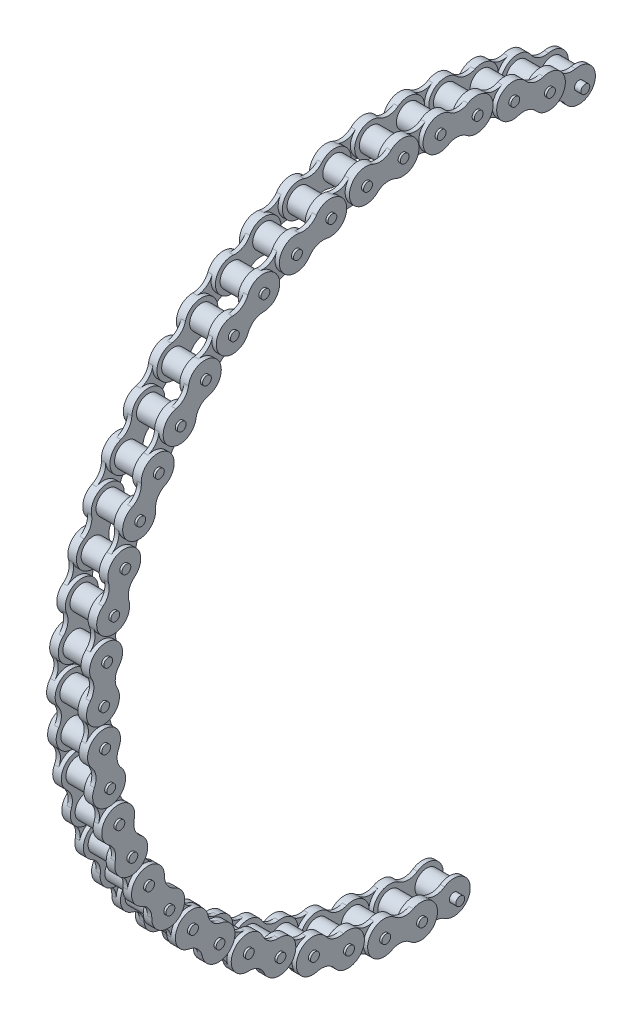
from build123d import *

# Parameters (mm, degrees)
BOSS_EXTRU_5_DEPTH      = 2.202
BOSS_EXTRU_5_2_DEPTH    = 2.202
BOSS_EXTRU_5_3_DEPTH    = 2.202
BOSS_EXTRU_5_4_DEPTH    = 2.202
BOSS_EXTRU_5_5_DEPTH    = 2.202
BOSS_EXTRU_5_6_DEPTH    = 2.202
BOSS_EXTRU_5_7_DEPTH    = 2.202
BOSS_EXTRU_5_8_DEPTH    = 2.202
BOSS_EXTRU_5_9_DEPTH    = 2.202
BOSS_EXTRU_5_10_DEPTH   = 2.202
BOSS_EXTRU_5_11_DEPTH   = 2.202
BOSS_EXTRU_5_12_DEPTH   = 2.202
BOSS_EXTRU_5_13_DEPTH   = 2.202
BOSS_EXTRU_5_14_DEPTH   = 2.202
BOSS_EXTRU_5_15_DEPTH   = 2.202
BOSS_EXTRU_5_16_DEPTH   = 2.202
BOSS_EXTRU_5_17_DEPTH   = 2.202
ESQUISSE4_R             = 6.05
BOSS_EXTRU_6_DEPTH      = 11.7
BOSS_EXTRU_7_DEPTH      = 2.202
BOSS_EXTRU_8_DEPTH      = 3.303
BOSS_EXTRU_8_DEPTH_BACK = 19.407
ESQUISSE6_R             = 2.269
BOSS_EXTRU_9_DEPTH      = 2.202
BOSS_EXTRU_10_START     = 2.202
BOSS_EXTRU_10_DEPTH     = 2.202
BOSS_EXTRU_11_START     = 2.202
BOSS_EXTRU_11_DEPTH     = 2.202


with BuildPart() as part:
    # Esquisse2 → Boss.-Extru.5 (new body)
    with BuildSketch(Plane(origin=(5.55, 0, 0), x_dir=(0, 0, -1), z_dir=(1, 0, 0))):
        with BuildLine():
            ThreePointArc((66.741727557, 151.674368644), (81.631052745, 153.185208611), (72.012148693, 164.650431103))
            ThreePointArc((72.012148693, 164.650431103), (67.051658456, 165.084816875), (63.193169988, 168.232390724))
            ThreePointArc((63.193169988, 168.232390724), (48.3038448, 166.721550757), (57.922748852, 155.256328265))
            ThreePointArc((57.922748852, 155.256328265), (62.883239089, 154.821942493), (66.741727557, 151.674368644))
        make_face()
    extrude(amount=BOSS_EXTRU_5_DEPTH)



with BuildPart() as body_2:
    # Esquisse2 → Boss.-Extru.5 2 (new body)
    with BuildSketch(Plane(origin=(5.55, 0, 0), x_dir=(0, 0, -1), z_dir=(1, 0, 0))):
        with BuildLine():
            ThreePointArc((31.958066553, 162.598444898), (46.156625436, 167.328726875), (34.2633089, 176.412980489))
            ThreePointArc((34.2633089, 176.412980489), (29.327888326, 175.752088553), (24.874474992, 177.979702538))
            ThreePointArc((24.874474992, 177.979702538), (10.675916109, 173.249420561), (22.569232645, 164.165166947))
            ThreePointArc((22.569232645, 164.165166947), (27.504653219, 164.826058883), (31.958066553, 162.598444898))
        make_face()
    extrude(amount=BOSS_EXTRU_5_2_DEPTH)


with BuildPart() as body_3:
    # Esquisse2 → Boss.-Extru.5 3 (new body)
    with BuildSketch(Plane(origin=(5.55, 0, 0), x_dir=(0, 0, -1), z_dir=(1, 0, 0))):
        with BuildLine():
            ThreePointArc((-4.372592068, 165.651600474), (8.44788932, 173.372345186), (-5.144118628, 179.635887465))
            ThreePointArc((-5.144118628, 179.635887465), (-9.815560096, 177.911709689), (-14.648321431, 179.111531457))
            ThreePointArc((-14.648321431, 179.111531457), (-27.468802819, 171.390786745), (-13.876794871, 165.127244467))
            ThreePointArc((-13.876794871, 165.127244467), (-9.205353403, 166.851422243), (-4.372592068, 165.651600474))
        make_face()
    extrude(amount=BOSS_EXTRU_5_3_DEPTH)


with BuildPart() as body_4:
    # Esquisse2 → Boss.-Extru.5 4 (new body)
    with BuildSketch(Plane(origin=(5.55, 0, 0), x_dir=(0, 0, -1), z_dir=(1, 0, 0))):
        with BuildLine():
            ThreePointArc((-40.491586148, 160.686040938), (-29.669784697, 171.023509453), (-44.302534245, 174.163140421))
            ThreePointArc((-44.302534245, 174.163140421), (-48.483865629, 171.459139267), (-53.462034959, 171.573088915))
            ThreePointArc((-53.462034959, 171.573088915), (-64.28383641, 161.2356204), (-49.651086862, 158.095989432))
            ThreePointArc((-49.651086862, 158.095989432), (-45.469755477, 160.799990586), (-40.491586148, 160.686040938))
        make_face()
    extrude(amount=BOSS_EXTRU_5_4_DEPTH)


with BuildPart() as body_5:
    # Esquisse2 → Boss.-Extru.5 5 (new body)
    with BuildSketch(Plane(origin=(5.55, 0, 0), x_dir=(0, 0, -1), z_dir=(1, 0, 0))):
        with BuildLine():
            ThreePointArc((-74.650499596, 147.942134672), (-66.351230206, 160.395920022), (-81.316392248, 160.259659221))
            ThreePointArc((-81.316392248, 160.259659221), (-84.805207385, 156.706727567), (-89.687805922, 155.729289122))
            ThreePointArc((-89.687805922, 155.729289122), (-97.987075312, 143.275503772), (-83.02191327, 143.411764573))
            ThreePointArc((-83.02191327, 143.411764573), (-79.533098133, 146.964696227), (-74.650499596, 147.942134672))
        make_face()
    extrude(amount=BOSS_EXTRU_5_5_DEPTH)


with BuildPart() as body_6:
    # Esquisse2 → Boss.-Extru.5 6 (new body)
    with BuildSketch(Plane(origin=(5.55, 0, 0), x_dir=(0, 0, -1), z_dir=(1, 0, 0))):
        with BuildLine():
            ThreePointArc((-105.195798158, 128.036777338), (-99.820804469, 142.004027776), (-114.393958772, 138.598471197))
            ThreePointArc((-114.393958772, 138.598471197), (-117.021374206, 134.368596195), (-121.572049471, 132.347084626))
            ThreePointArc((-121.572049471, 132.347084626), (-126.94704316, 118.379834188), (-112.373888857, 121.785390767))
            ThreePointArc((-112.373888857, 121.785390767), (-109.746473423, 126.015265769), (-105.195798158, 128.036777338))
        make_face()
    extrude(amount=BOSS_EXTRU_5_6_DEPTH)


with BuildPart() as body_7:
    # Esquisse2 → Boss.-Extru.5 7 (new body)
    with BuildSketch(Plane(origin=(5.55, 0, 0), x_dir=(0, 0, -1), z_dir=(1, 0, 0))):
        with BuildLine():
            ThreePointArc((-130.648872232, 101.933529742), (-128.458342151, 116.738131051), (-141.934044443, 110.228131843))
            ThreePointArc((-141.934044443, 110.228131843), (-143.572874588, 105.526069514), (-147.571341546, 102.558340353))
            ThreePointArc((-147.571341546, 102.558340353), (-149.761871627, 87.753739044), (-136.286169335, 94.263738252))
            ThreePointArc((-136.286169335, 94.263738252), (-134.64733919, 98.965800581), (-130.648872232, 101.933529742))
        make_face()
    extrude(amount=BOSS_EXTRU_5_7_DEPTH)


with BuildPart() as body_8:
    # Esquisse2 → Boss.-Extru.5 8 (new body)
    with BuildSketch(Plane(origin=(5.55, 0, 0), x_dir=(0, 0, -1), z_dir=(1, 0, 0))):
        with BuildLine():
            ThreePointArc((-149.777612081, 70.895974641), (-150.877582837, 85.821278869), (-162.603513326, 76.521967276))
            ThreePointArc((-162.603513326, 76.521967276), (-163.174427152, 71.575330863), (-166.427131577, 67.805043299))
            ThreePointArc((-166.427131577, 67.805043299), (-165.327160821, 52.879739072), (-153.601230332, 62.179050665))
            ThreePointArc((-153.601230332, 62.179050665), (-153.030316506, 67.125687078), (-149.777612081, 70.895974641))
        make_face()
    extrude(amount=BOSS_EXTRU_5_8_DEPTH)


with BuildPart() as body_9:
    # Esquisse2 → Boss.-Extru.5 9 (new body)
    with BuildSketch(Plane(origin=(5.55, 0, 0), x_dir=(0, 0, -1), z_dir=(1, 0, 0))):
        with BuildLine():
            ThreePointArc((-161.656050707, 36.426550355), (-165.993275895, 50.75006667), (-175.401816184, 39.111595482))
            ThreePointArc((-175.401816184, 39.111595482), (-174.877177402, 34.159837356), (-177.226665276, 29.769500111))
            ThreePointArc((-177.226665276, 29.769500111), (-172.889440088, 15.445983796), (-163.4808998, 27.084454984))
            ThreePointArc((-163.4808998, 27.084454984), (-164.005538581, 32.03621311), (-161.656050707, 36.426550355))
        make_face()
    extrude(amount=BOSS_EXTRU_5_9_DEPTH)


with BuildPart() as body_10:
    # Esquisse2 → Boss.-Extru.5 10 (new body)
    with BuildSketch(Plane(origin=(5.55, 0, 0), x_dir=(0, 0, -1), z_dir=(1, 0, 0))):
        with BuildLine():
            ThreePointArc((-165.709187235, 0.193822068), (-173.073714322, 13.222190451), (-179.709424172, -0.192055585))
            ThreePointArc((-179.709424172, -0.192055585), (-178.114629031, -4.909235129), (-179.447168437, -9.707098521))
            ThreePointArc((-179.447168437, -9.707098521), (-172.08264135, -22.735466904), (-165.446931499, -9.321220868))
            ThreePointArc((-165.446931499, -9.321220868), (-167.041726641, -4.604041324), (-165.709187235, 0.193822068))
        make_face()
    extrude(amount=BOSS_EXTRU_5_10_DEPTH)


with BuildPart() as body_11:
    # Esquisse2 → Boss.-Extru.5 11 (new body)
    with BuildSketch(Plane(origin=(5.55, 0, 0), x_dir=(0, 0, -1), z_dir=(1, 0, 0))):
        with BuildLine():
            ThreePointArc((-161.740821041, -36.048288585), (-171.77615456, -24.945733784), (-175.317818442, -39.486409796))
            ThreePointArc((-175.317818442, -39.486409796), (-172.730066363, -43.740665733), (-172.98115292, -48.713804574))
            ThreePointArc((-172.98115292, -48.713804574), (-162.945819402, -59.816359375), (-159.40415552, -45.275683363))
            ThreePointArc((-159.40415552, -45.275683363), (-161.991907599, -41.021427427), (-161.740821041, -36.048288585))
        make_face()
    extrude(amount=BOSS_EXTRU_5_11_DEPTH)


with BuildPart() as body_12:
    # Esquisse2 → Boss.-Extru.5 12 (new body)
    with BuildSketch(Plane(origin=(5.55, 0, 0), x_dir=(0, 0, -1), z_dir=(1, 0, 0))):
        with BuildLine():
            ThreePointArc((-149.943049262, -70.545405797), (-162.163407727, -61.90610716), (-162.439583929, -76.869341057))
            ThreePointArc((-162.439583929, -76.869341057), (-158.984140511, -80.454737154), (-158.141619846, -85.36241617))
            ThreePointArc((-158.141619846, -85.36241617), (-145.921261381, -94.001714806), (-145.645085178, -79.038480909))
            ThreePointArc((-145.645085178, -79.038480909), (-149.100528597, -75.453084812), (-149.943049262, -70.545405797))
        make_face()
    extrude(amount=BOSS_EXTRU_5_12_DEPTH)


with BuildPart() as body_13:
    # Esquisse2 → Boss.-Extru.5 13 (new body)
    with BuildSketch(Plane(origin=(5.55, 0, 0), x_dir=(0, 0, -1), z_dir=(1, 0, 0))):
        with BuildLine():
            ThreePointArc((-130.886967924, -101.627623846), (-144.700799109, -95.869784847), (-141.69811874, -110.531249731))
            ThreePointArc((-141.69811874, -110.531249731), (-137.542252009, -113.274227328), (-135.646908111, -117.878879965))
            ThreePointArc((-135.646908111, -117.878879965), (-121.833076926, -123.636718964), (-124.835757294, -108.97525408))
            ThreePointArc((-124.835757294, -108.97525408), (-128.991624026, -106.232276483), (-130.886967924, -101.627623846))
        make_face()
    extrude(amount=BOSS_EXTRU_5_13_DEPTH)


with BuildPart() as body_14:
    # Esquisse2 → Boss.-Extru.5 14 (new body)
    with BuildSketch(Plane(origin=(5.55, 0, 0), x_dir=(0, 0, -1), z_dir=(1, 0, 0))):
        with BuildLine():
            ThreePointArc((-105.495026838, -127.790342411), (-120.233643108, -125.19268339), (-114.097457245, -138.84266013))
            ThreePointArc((-114.097457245, -138.84266013), (-109.442340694, -140.610439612), (-106.585921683, -144.689167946))
            ThreePointArc((-106.585921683, -144.689167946), (-91.847305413, -147.286826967), (-97.983491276, -133.636850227))
            ThreePointArc((-97.983491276, -133.636850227), (-102.638607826, -131.869070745), (-105.495026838, -127.790342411))
        make_face()
    extrude(amount=BOSS_EXTRU_5_14_DEPTH)


with BuildPart() as body_15:
    # Esquisse2 → Boss.-Extru.5 15 (new body)
    with BuildSketch(Plane(origin=(5.55, 0, 0), x_dir=(0, 0, -1), z_dir=(1, 0, 0))):
        with BuildLine():
            ThreePointArc((-74.996376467, -147.767099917), (-89.946324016, -148.455366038), (-80.973667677, -160.433098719))
            ThreePointArc((-80.973667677, -160.433098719), (-76.044642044, -161.14010699), (-72.365418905, -164.495471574))
            ThreePointArc((-72.365418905, -164.495471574), (-57.415471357, -163.807205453), (-66.388127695, -151.829472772))
            ThreePointArc((-66.388127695, -151.829472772), (-71.317153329, -151.1224645), (-74.996376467, -147.767099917))
        make_face()
    extrude(amount=BOSS_EXTRU_5_15_DEPTH)


with BuildPart() as body_16:
    # Esquisse2 → Boss.-Extru.5 16 (new body)
    with BuildSketch(Plane(origin=(5.55, 0, 0), x_dir=(0, 0, -1), z_dir=(1, 0, 0))):
        with BuildLine():
            ThreePointArc((-40.867368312, -160.590879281), (-55.304963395, -164.531753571), (-43.930176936, -174.25743478))
            ThreePointArc((-43.930176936, -174.25743478), (-38.965842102, -173.869447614), (-34.641915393, -176.339024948))
            ThreePointArc((-34.641915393, -176.339024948), (-20.20432031, -172.398150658), (-31.579106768, -162.672469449))
            ThreePointArc((-31.579106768, -162.672469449), (-36.543441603, -163.060456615), (-40.867368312, -160.590879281))
        make_face()
    extrude(amount=BOSS_EXTRU_5_16_DEPTH)


with BuildPart() as body_17:
    # Esquisse2 → Boss.-Extru.5 17 (new body)
    with BuildSketch(Plane(origin=(5.55, 0, 0), x_dir=(0, 0, -1), z_dir=(1, 0, 0))):
        with BuildLine():
            ThreePointArc((-4.760088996, -165.640918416), (-17.986449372, -172.643634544), (-4.760153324, -179.646472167))
            ThreePointArc((-4.760153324, -179.646472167), (-0.000818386, -178.182270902), (4.758503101, -179.646515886))
            ThreePointArc((4.758503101, -179.646515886), (17.984863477, -172.643799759), (4.758567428, -165.640962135))
            ThreePointArc((4.758567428, -165.640962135), (-0.000767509, -167.1051634), (-4.760088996, -165.640918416))
        make_face()
    extrude(amount=BOSS_EXTRU_5_17_DEPTH)


with BuildPart() as part_1:
    add(part.part)

    add(body_2.part)  # Boss.-Extru.6 merges body 2

    add(body_3.part)  # Boss.-Extru.6 merges body 3

    add(body_4.part)  # Boss.-Extru.6 merges body 4

    add(body_5.part)  # Boss.-Extru.6 merges body 5

    add(body_6.part)  # Boss.-Extru.6 merges body 6

    add(body_7.part)  # Boss.-Extru.6 merges body 7

    add(body_8.part)  # Boss.-Extru.6 merges body 8

    add(body_9.part)  # Boss.-Extru.6 merges body 9

    add(body_10.part)  # Boss.-Extru.6 merges body 10

    add(body_11.part)  # Boss.-Extru.6 merges body 11

    add(body_12.part)  # Boss.-Extru.6 merges body 12

    add(body_13.part)  # Boss.-Extru.6 merges body 13

    add(body_14.part)  # Boss.-Extru.6 merges body 14

    add(body_15.part)  # Boss.-Extru.6 merges body 15

    add(body_16.part)  # Boss.-Extru.6 merges body 16

    add(body_17.part)  # Boss.-Extru.6 merges body 17
    # Esquisse4 → Boss.-Extru.6 (add)
    with BuildSketch(Plane(origin=(7.752, 0, 0), x_dir=(0, 0, -1), z_dir=(1, 0, 0))):
        with Locations((73.786427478, 156.371420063)):
            Circle(ESQUISSE4_R)
        with Locations((56.148470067, 163.535339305)):
            Circle(ESQUISSE4_R)
        with Locations((37.805104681, 168.722351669)):
            Circle(ESQUISSE4_R)
        with Locations((19.027436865, 171.855795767)):
            Circle(ESQUISSE4_R)
        with Locations((-0.006253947, 172.905921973)):
            Circle(ESQUISSE4_R)
        with Locations((-19.014659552, 171.857209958)):
            Circle(ESQUISSE4_R)
        with Locations((-37.817309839, 168.719616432)):
            Circle(ESQUISSE4_R)
        with Locations((-56.136311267, 163.53951342)):
            Circle(ESQUISSE4_R)
        with Locations((-73.797739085, 156.366081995)):
            Circle(ESQUISSE4_R)
        with Locations((-90.540566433, 147.305341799)):
            Circle(ESQUISSE4_R)
        with Locations((-106.205833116, 136.443317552)):
            Circle(ESQUISSE4_R)
        with Locations((-120.562014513, 123.940544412)):
            Circle(ESQUISSE4_R)
        with Locations((-133.472809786, 109.915726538)):
            Circle(ESQUISSE4_R)
        with Locations((-144.747403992, 94.576143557)):
            Circle(ESQUISSE4_R)
        with Locations((-154.278753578, 78.067432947)):
            Circle(ESQUISSE4_R)
        with Locations((-161.92599008, 60.633584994)):
            Circle(ESQUISSE4_R)
        with Locations((-167.616508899, 42.440120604)):
            Circle(ESQUISSE4_R)
        with Locations((-171.266207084, 23.755929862)):
            Circle(ESQUISSE4_R)
        with Locations((-172.840433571, 4.758404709)):
            Circle(ESQUISSE4_R)
        with Locations((-172.3159221, -14.271681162)):
            Circle(ESQUISSE4_R)
        with Locations((-169.697652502, -33.153651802)):
            Circle(ESQUISSE4_R)
        with Locations((-165.02432146, -51.608441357)):
            Circle(ESQUISSE4_R)
        with Locations((-158.340298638, -69.460835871)):
            Circle(ESQUISSE4_R)
        with Locations((-149.74437047, -86.446986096)):
            Circle(ESQUISSE4_R)
        with Locations((-139.318148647, -102.405621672)):
            Circle(ESQUISSE4_R)
        with Locations((-127.215727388, -117.100882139)):
            Circle(ESQUISSE4_R)
        with Locations((-113.552009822, -130.393247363)):
            Circle(ESQUISSE4_R)
        with Locations((-98.528938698, -142.086262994)):
            Circle(ESQUISSE4_R)
        with Locations((-82.289146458, -152.068912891)):
            Circle(ESQUISSE4_R)
        with Locations((-65.072648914, -160.1936586)):
            Circle(ESQUISSE4_R)
        with Locations((-47.042903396, -166.383361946)):
            Circle(ESQUISSE4_R)
        with Locations((-28.466380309, -170.546542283)):
            Circle(ESQUISSE4_R)
        with Locations((-9.519449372, -172.643673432)):
            Circle(ESQUISSE4_R)
        with Locations((9.517863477, -172.64376087)):
            Circle(ESQUISSE4_R)
    extrude(amount=BOSS_EXTRU_6_DEPTH)

    # Esquisse5 → Boss.-Extru.7 (add)
    with BuildSketch(Plane(origin=(19.452, 0, 0), x_dir=(0, 0, -1), z_dir=(1, 0, 0))):
        with BuildLine():
            ThreePointArc((66.741727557, 151.674368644), (81.631052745, 153.185208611), (72.012148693, 164.650431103))
            ThreePointArc((72.012148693, 164.650431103), (67.051658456, 165.084816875), (63.193169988, 168.232390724))
            ThreePointArc((63.193169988, 168.232390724), (48.3038448, 166.721550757), (57.922748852, 155.256328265))
            ThreePointArc((57.922748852, 155.256328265), (62.883239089, 154.821942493), (66.741727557, 151.674368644))
        make_face()
        with BuildLine():
            ThreePointArc((31.958066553, 162.598444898), (46.156625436, 167.328726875), (34.2633089, 176.412980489))
            ThreePointArc((34.2633089, 176.412980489), (29.327888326, 175.752088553), (24.874474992, 177.979702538))
            ThreePointArc((24.874474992, 177.979702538), (10.675916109, 173.249420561), (22.569232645, 164.165166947))
            ThreePointArc((22.569232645, 164.165166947), (27.504653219, 164.826058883), (31.958066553, 162.598444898))
        make_face()
        with BuildLine():
            ThreePointArc((-4.372592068, 165.651600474), (8.44788932, 173.372345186), (-5.144118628, 179.635887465))
            ThreePointArc((-5.144118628, 179.635887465), (-9.815560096, 177.911709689), (-14.648321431, 179.111531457))
            ThreePointArc((-14.648321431, 179.111531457), (-27.468802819, 171.390786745), (-13.876794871, 165.127244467))
            ThreePointArc((-13.876794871, 165.127244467), (-9.205353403, 166.851422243), (-4.372592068, 165.651600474))
        make_face()
        with BuildLine():
            ThreePointArc((-40.491586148, 160.686040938), (-29.669784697, 171.023509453), (-44.302534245, 174.163140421))
            ThreePointArc((-44.302534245, 174.163140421), (-48.483865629, 171.459139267), (-53.462034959, 171.573088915))
            ThreePointArc((-53.462034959, 171.573088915), (-64.28383641, 161.2356204), (-49.651086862, 158.095989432))
            ThreePointArc((-49.651086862, 158.095989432), (-45.469755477, 160.799990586), (-40.491586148, 160.686040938))
        make_face()
        with BuildLine():
            ThreePointArc((-74.650499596, 147.942134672), (-66.351230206, 160.395920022), (-81.316392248, 160.259659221))
            ThreePointArc((-81.316392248, 160.259659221), (-84.805207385, 156.706727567), (-89.687805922, 155.729289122))
            ThreePointArc((-89.687805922, 155.729289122), (-97.987075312, 143.275503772), (-83.02191327, 143.411764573))
            ThreePointArc((-83.02191327, 143.411764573), (-79.533098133, 146.964696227), (-74.650499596, 147.942134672))
        make_face()
        with BuildLine():
            ThreePointArc((-105.195798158, 128.036777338), (-99.820804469, 142.004027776), (-114.393958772, 138.598471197))
            ThreePointArc((-114.393958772, 138.598471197), (-117.021374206, 134.368596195), (-121.572049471, 132.347084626))
            ThreePointArc((-121.572049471, 132.347084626), (-126.94704316, 118.379834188), (-112.373888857, 121.785390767))
            ThreePointArc((-112.373888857, 121.785390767), (-109.746473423, 126.015265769), (-105.195798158, 128.036777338))
        make_face()
        with BuildLine():
            ThreePointArc((-130.648872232, 101.933529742), (-128.458342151, 116.738131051), (-141.934044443, 110.228131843))
            ThreePointArc((-141.934044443, 110.228131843), (-143.572874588, 105.526069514), (-147.571341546, 102.558340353))
            ThreePointArc((-147.571341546, 102.558340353), (-149.761871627, 87.753739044), (-136.286169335, 94.263738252))
            ThreePointArc((-136.286169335, 94.263738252), (-134.64733919, 98.965800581), (-130.648872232, 101.933529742))
        make_face()
        with BuildLine():
            ThreePointArc((-149.777612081, 70.895974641), (-150.877582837, 85.821278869), (-162.603513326, 76.521967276))
            ThreePointArc((-162.603513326, 76.521967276), (-163.174427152, 71.575330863), (-166.427131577, 67.805043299))
            ThreePointArc((-166.427131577, 67.805043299), (-165.327160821, 52.879739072), (-153.601230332, 62.179050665))
            ThreePointArc((-153.601230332, 62.179050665), (-153.030316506, 67.125687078), (-149.777612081, 70.895974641))
        make_face()
        with BuildLine():
            ThreePointArc((-161.656050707, 36.426550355), (-165.993275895, 50.75006667), (-175.401816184, 39.111595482))
            ThreePointArc((-175.401816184, 39.111595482), (-174.877177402, 34.159837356), (-177.226665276, 29.769500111))
            ThreePointArc((-177.226665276, 29.769500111), (-172.889440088, 15.445983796), (-163.4808998, 27.084454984))
            ThreePointArc((-163.4808998, 27.084454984), (-164.005538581, 32.03621311), (-161.656050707, 36.426550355))
        make_face()
        with BuildLine():
            ThreePointArc((-165.709187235, 0.193822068), (-173.073714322, 13.222190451), (-179.709424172, -0.192055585))
            ThreePointArc((-179.709424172, -0.192055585), (-178.114629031, -4.909235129), (-179.447168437, -9.707098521))
            ThreePointArc((-179.447168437, -9.707098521), (-172.08264135, -22.735466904), (-165.446931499, -9.321220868))
            ThreePointArc((-165.446931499, -9.321220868), (-167.041726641, -4.604041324), (-165.709187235, 0.193822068))
        make_face()
        with BuildLine():
            ThreePointArc((-161.740821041, -36.048288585), (-171.77615456, -24.945733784), (-175.317818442, -39.486409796))
            ThreePointArc((-175.317818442, -39.486409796), (-172.730066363, -43.740665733), (-172.98115292, -48.713804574))
            ThreePointArc((-172.98115292, -48.713804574), (-162.945819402, -59.816359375), (-159.40415552, -45.275683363))
            ThreePointArc((-159.40415552, -45.275683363), (-161.991907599, -41.021427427), (-161.740821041, -36.048288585))
        make_face()
        with BuildLine():
            ThreePointArc((-149.943049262, -70.545405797), (-162.163407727, -61.90610716), (-162.439583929, -76.869341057))
            ThreePointArc((-162.439583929, -76.869341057), (-158.984140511, -80.454737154), (-158.141619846, -85.36241617))
            ThreePointArc((-158.141619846, -85.36241617), (-145.921261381, -94.001714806), (-145.645085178, -79.038480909))
            ThreePointArc((-145.645085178, -79.038480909), (-149.100528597, -75.453084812), (-149.943049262, -70.545405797))
        make_face()
        with BuildLine():
            ThreePointArc((-130.886967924, -101.627623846), (-144.700799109, -95.869784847), (-141.69811874, -110.531249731))
            ThreePointArc((-141.69811874, -110.531249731), (-137.542252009, -113.274227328), (-135.646908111, -117.878879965))
            ThreePointArc((-135.646908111, -117.878879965), (-121.833076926, -123.636718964), (-124.835757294, -108.97525408))
            ThreePointArc((-124.835757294, -108.97525408), (-128.991624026, -106.232276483), (-130.886967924, -101.627623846))
        make_face()
        with BuildLine():
            ThreePointArc((-105.495026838, -127.790342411), (-120.233643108, -125.19268339), (-114.097457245, -138.84266013))
            ThreePointArc((-114.097457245, -138.84266013), (-109.442340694, -140.610439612), (-106.585921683, -144.689167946))
            ThreePointArc((-106.585921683, -144.689167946), (-91.847305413, -147.286826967), (-97.983491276, -133.636850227))
            ThreePointArc((-97.983491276, -133.636850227), (-102.638607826, -131.869070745), (-105.495026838, -127.790342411))
        make_face()
        with BuildLine():
            ThreePointArc((-74.996376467, -147.767099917), (-89.946324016, -148.455366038), (-80.973667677, -160.433098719))
            ThreePointArc((-80.973667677, -160.433098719), (-76.044642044, -161.14010699), (-72.365418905, -164.495471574))
            ThreePointArc((-72.365418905, -164.495471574), (-57.415471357, -163.807205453), (-66.388127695, -151.829472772))
            ThreePointArc((-66.388127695, -151.829472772), (-71.317153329, -151.1224645), (-74.996376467, -147.767099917))
        make_face()
        with BuildLine():
            ThreePointArc((-40.867368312, -160.590879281), (-55.304963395, -164.531753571), (-43.930176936, -174.25743478))
            ThreePointArc((-43.930176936, -174.25743478), (-38.965842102, -173.869447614), (-34.641915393, -176.339024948))
            ThreePointArc((-34.641915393, -176.339024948), (-20.20432031, -172.398150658), (-31.579106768, -162.672469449))
            ThreePointArc((-31.579106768, -162.672469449), (-36.543441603, -163.060456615), (-40.867368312, -160.590879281))
        make_face()
        with BuildLine():
            ThreePointArc((-4.760088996, -165.640918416), (-17.986449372, -172.643634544), (-4.760153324, -179.646472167))
            ThreePointArc((-4.760153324, -179.646472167), (-0.000818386, -178.182270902), (4.758503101, -179.646515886))
            ThreePointArc((4.758503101, -179.646515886), (17.984863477, -172.643799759), (4.758567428, -165.640962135))
            ThreePointArc((4.758567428, -165.640962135), (-0.000767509, -167.1051634), (-4.760088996, -165.640918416))
        make_face()
    extrude(amount=BOSS_EXTRU_7_DEPTH)

    # Esquisse6 → Boss.-Extru.8 (add, two sides: drawn at the far end of the back side and taken through both)
    with BuildSketch(Plane(origin=(21.654, 0, 0), x_dir=(0, 0, -1), z_dir=(1, 0, 0)).offset(-BOSS_EXTRU_8_DEPTH_BACK)):
        with Locations((73.786427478, 156.371420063)):
            Circle(ESQUISSE6_R)
        with Locations((56.148470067, 163.535339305)):
            Circle(ESQUISSE6_R)
        with Locations((19.027436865, 171.855795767)):
            Circle(ESQUISSE6_R)
        with Locations((37.805104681, 168.722351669)):
            Circle(ESQUISSE6_R)
        with Locations((-19.014659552, 171.857209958)):
            Circle(ESQUISSE6_R)
        with Locations((-0.006253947, 172.905921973)):
            Circle(ESQUISSE6_R)
        with Locations((-56.136311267, 163.53951342)):
            Circle(ESQUISSE6_R)
        with Locations((-37.817309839, 168.719616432)):
            Circle(ESQUISSE6_R)
        with Locations((-90.540566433, 147.305341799)):
            Circle(ESQUISSE6_R)
        with Locations((-73.797739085, 156.366081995)):
            Circle(ESQUISSE6_R)
        with Locations((-120.562014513, 123.940544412)):
            Circle(ESQUISSE6_R)
        with Locations((-106.205833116, 136.443317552)):
            Circle(ESQUISSE6_R)
        with Locations((-144.747403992, 94.576143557)):
            Circle(ESQUISSE6_R)
        with Locations((-133.472809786, 109.915726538)):
            Circle(ESQUISSE6_R)
        with Locations((-161.92599008, 60.633584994)):
            Circle(ESQUISSE6_R)
        with Locations((-154.278753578, 78.067432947)):
            Circle(ESQUISSE6_R)
        with Locations((-171.266207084, 23.755929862)):
            Circle(ESQUISSE6_R)
        with Locations((-167.616508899, 42.440120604)):
            Circle(ESQUISSE6_R)
        with Locations((-172.3159221, -14.271681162)):
            Circle(ESQUISSE6_R)
        with Locations((-172.840433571, 4.758404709)):
            Circle(ESQUISSE6_R)
        with Locations((-165.02432146, -51.608441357)):
            Circle(ESQUISSE6_R)
        with Locations((-169.697652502, -33.153651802)):
            Circle(ESQUISSE6_R)
        with Locations((-149.74437047, -86.446986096)):
            Circle(ESQUISSE6_R)
        with Locations((-158.340298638, -69.460835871)):
            Circle(ESQUISSE6_R)
        with Locations((-127.215727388, -117.100882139)):
            Circle(ESQUISSE6_R)
        with Locations((-139.318148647, -102.405621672)):
            Circle(ESQUISSE6_R)
        with Locations((-98.528938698, -142.086262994)):
            Circle(ESQUISSE6_R)
        with Locations((-113.552009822, -130.393247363)):
            Circle(ESQUISSE6_R)
        with Locations((-65.072648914, -160.1936586)):
            Circle(ESQUISSE6_R)
        with Locations((-82.289146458, -152.068912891)):
            Circle(ESQUISSE6_R)
        with Locations((-28.466380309, -170.546542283)):
            Circle(ESQUISSE6_R)
        with Locations((-47.042903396, -166.383361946)):
            Circle(ESQUISSE6_R)
        with Locations((9.517863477, -172.64376087)):
            Circle(ESQUISSE6_R)
        with Locations((-9.519449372, -172.643673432)):
            Circle(ESQUISSE6_R)
    extrude(amount=BOSS_EXTRU_8_DEPTH + BOSS_EXTRU_8_DEPTH_BACK)

    # Esquisse7 → Boss.-Extru.9 (add)
    with BuildSketch(Plane(origin=(21.654, 0, 0), x_dir=(0, 0, -1), z_dir=(1, 0, 0))):
        with BuildLine():
            ThreePointArc((49.658319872, 158.097689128), (64.295992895, 161.231438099), (53.466937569, 171.566495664))
            ThreePointArc((53.466937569, 171.566495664), (48.481503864, 171.450129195), (44.295254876, 174.160001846))
            ThreePointArc((44.295254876, 174.160001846), (29.657581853, 171.026252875), (40.486637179, 160.69119531))
            ThreePointArc((40.486637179, 160.69119531), (45.472070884, 160.807561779), (49.658319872, 158.097689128))
        make_face()
        with BuildLine():
            ThreePointArc((5.137701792, 179.631232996), (-8.460396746, 173.37235368), (4.36663572, 165.655547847))
            ThreePointArc((4.36663572, 165.655547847), (9.205957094, 166.859316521), (13.883481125, 165.130484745))
            ThreePointArc((13.883481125, 165.130484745), (27.481579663, 171.38936406), (14.654547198, 179.106169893))
            ThreePointArc((14.654547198, 179.106169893), (9.815225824, 177.90240122), (5.137701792, 179.631232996))
        make_face()
        with BuildLine():
            ThreePointArc((-34.268552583, 176.407035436), (-46.168831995, 167.32600003), (-31.964741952, 162.600994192))
            ThreePointArc((-31.964741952, 162.600994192), (-27.505790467, 164.833894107), (-22.563416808, 164.169790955))
            ThreePointArc((-22.563416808, 164.169790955), (-10.663137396, 173.250826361), (-24.867227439, 177.975832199))
            ThreePointArc((-24.867227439, 177.975832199), (-29.326178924, 175.742932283), (-34.268552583, 176.407035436))
        make_face()
        with BuildLine():
            ThreePointArc((-72.015965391, 164.643483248), (-81.642367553, 153.179878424), (-66.748798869, 151.675396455))
            ThreePointArc((-66.748798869, 151.675396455), (-62.886062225, 154.829339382), (-57.918084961, 155.262112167))
            ThreePointArc((-57.918084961, 155.262112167), (-48.291682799, 166.725716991), (-63.185251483, 168.230198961))
            ThreePointArc((-63.185251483, 168.230198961), (-67.047988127, 165.076256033), (-72.015965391, 164.643483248))
        make_face()
        with BuildLine():
            ThreePointArc((-106.277293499, 144.910015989), (-113.163832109, 131.618761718), (-98.301739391, 133.407631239))
            ThreePointArc((-98.301739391, 133.407631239), (-95.222201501, 137.32994392), (-90.46910605, 138.838643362))
            ThreePointArc((-90.46910605, 138.838643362), (-83.582567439, 152.129897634), (-98.444660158, 150.341028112))
            ThreePointArc((-98.444660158, 150.341028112), (-101.524198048, 146.418715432), (-106.277293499, 144.910015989))
        make_face()
        with BuildLine():
            ThreePointArc((-135.394045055, 118.161873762), (-139.207362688, 103.68636124), (-125.09617688, 108.681988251))
            ThreePointArc((-125.09617688, 108.681988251), (-122.948909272, 113.182802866), (-118.640779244, 115.694397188))
            ThreePointArc((-118.640779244, 115.694397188), (-114.827461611, 130.169909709), (-128.938647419, 125.174282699))
            ThreePointArc((-128.938647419, 125.174282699), (-131.085915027, 120.673468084), (-135.394045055, 118.161873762))
        make_face()
        with BuildLine():
            ThreePointArc((-157.956762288, 85.693856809), (-158.51226726, 70.734803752), (-145.835070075, 78.695364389))
            ThreePointArc((-145.835070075, 78.695364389), (-144.724015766, 83.556809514), (-141.069395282, 86.949719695))
            ThreePointArc((-141.069395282, 86.949719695), (-140.51389031, 101.908772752), (-153.191087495, 93.948212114))
            ThreePointArc((-153.191087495, 93.948212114), (-154.302141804, 89.086766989), (-157.956762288, 85.693856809))
        make_face()
        with BuildLine():
            ThreePointArc((-172.873249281, 49.077647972), (-170.144051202, 34.359178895), (-159.514509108, 44.899325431))
            ThreePointArc((-159.514509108, 44.899325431), (-159.493451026, 49.886072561), (-156.669249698, 53.996057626))
            ThreePointArc((-156.669249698, 53.996057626), (-159.398447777, 68.714526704), (-170.027989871, 58.174380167))
            ThreePointArc((-170.027989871, 58.174380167), (-170.049047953, 53.187633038), (-172.873249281, 49.077647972))
        make_face()
        with BuildLine():
            ThreePointArc((-179.421442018, 10.085732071), (-173.539653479, -3.679674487), (-165.472311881, 8.929839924))
            ThreePointArc((-165.472311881, 8.929839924), (-166.542269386, 13.800495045), (-164.685198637, 18.4286025))
            ThreePointArc((-164.685198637, 18.4286025), (-170.566987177, 32.194009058), (-178.634328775, 19.584494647))
            ThreePointArc((-178.634328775, 19.584494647), (-177.564371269, 14.713839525), (-179.421442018, 10.085732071))
        make_face()
        with BuildLine():
            ThreePointArc((-177.28436142, -29.394404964), (-168.534702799, -41.540405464), (-163.420078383, -27.47191332))
            ThreePointArc((-163.420078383, -27.47191332), (-165.529257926, -22.953124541), (-164.729213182, -18.030928))
            ThreePointArc((-164.729213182, -18.030928), (-173.478871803, -5.8849275), (-178.593496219, -19.953419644))
            ThreePointArc((-178.593496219, -19.953419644), (-176.484316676, -24.472208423), (-177.28436142, -29.394404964))
        make_face()
        with BuildLine():
            ThreePointArc((-166.56545738, -67.451643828), (-155.371474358, -77.390285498), (-153.457151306, -62.543830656))
            ThreePointArc((-153.457151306, -62.543830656), (-156.503453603, -58.595649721), (-156.799162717, -53.617633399))
            ThreePointArc((-156.799162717, -53.617633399), (-167.993145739, -43.678991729), (-169.907468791, -58.525446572))
            ThreePointArc((-169.907468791, -58.525446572), (-166.861166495, -62.473627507), (-166.56545738, -67.451643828))
        make_face()
        with BuildLine():
            ThreePointArc((-147.783601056, -102.243743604), (-134.687161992, -109.493925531), (-136.065807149, -94.588181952))
            ThreePointArc((-136.065807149, -94.588181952), (-139.901769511, -91.401728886), (-141.278918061, -86.608864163))
            ThreePointArc((-141.278918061, -86.608864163), (-154.375357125, -79.358682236), (-152.996711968, -94.264425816))
            ThreePointArc((-152.996711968, -94.264425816), (-149.160749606, -97.450878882), (-147.783601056, -102.243743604))
        make_face()
        with BuildLine():
            ThreePointArc((-121.847967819, -132.086519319), (-107.483033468, -136.297281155), (-112.087910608, -122.053792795))
            ThreePointArc((-112.087910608, -122.053792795), (-116.527845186, -119.783314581), (-118.919769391, -115.407610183))
            ThreePointArc((-118.919769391, -115.407610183), (-133.284703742, -111.196848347), (-128.679826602, -125.440336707))
            ThreePointArc((-128.679826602, -125.440336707), (-124.239892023, -127.710814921), (-121.847967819, -132.086519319))
        make_face()
        with BuildLine():
            ThreePointArc((-90.014026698, -155.53536847), (-75.075962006, -156.502879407), (-82.684162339, -143.611132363))
            ThreePointArc((-82.684162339, -143.611132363), (-87.513144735, -142.366536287), (-90.804058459, -138.619807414))
            ThreePointArc((-90.804058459, -138.619807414), (-105.74212315, -137.652296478), (-98.133922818, -150.544043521))
            ThreePointArc((-98.133922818, -150.544043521), (-93.304940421, -151.788639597), (-90.014026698, -155.53536847))
        make_face()
        with BuildLine():
            ThreePointArc((-53.822766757, -171.455200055), (-39.034680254, -169.132625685), (-49.277912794, -158.216672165))
            ThreePointArc((-49.277912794, -158.216672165), (-54.262185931, -158.058205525), (-58.292785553, -155.121820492))
            ThreePointArc((-58.292785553, -155.121820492), (-73.080872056, -157.444394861), (-62.837639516, -168.360348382))
            ThreePointArc((-62.837639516, -168.360348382), (-57.85336638, -168.518815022), (-53.822766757, -171.455200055))
        make_face()
        with BuildLine():
            ThreePointArc((-15.026102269, -179.075381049), (-1.103842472, -173.575150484), (-13.486261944, -165.16340024))
            ThreePointArc((-13.486261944, -165.16340024), (-18.384551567, -166.098733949), (-22.959727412, -164.114834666))
            ThreePointArc((-22.959727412, -164.114834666), (-36.881987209, -169.615065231), (-24.499567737, -178.026815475))
            ThreePointArc((-24.499567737, -178.026815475), (-19.601278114, -177.091481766), (-15.026102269, -179.075381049))
        make_face()
    extrude(amount=BOSS_EXTRU_9_DEPTH)

    # Esquisse8 → Boss.-Extru.10 (add)
    with BuildSketch(Plane.ZY.offset(-5.55).offset(BOSS_EXTRU_10_START)):
        with BuildLine():
            ThreePointArc((-53.466937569, 171.566495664), (-64.295992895, 161.231438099), (-49.658319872, 158.097689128))
            ThreePointArc((-49.658319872, 158.097689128), (-45.472070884, 160.807561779), (-40.486637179, 160.69119531))
            ThreePointArc((-40.486637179, 160.69119531), (-29.657581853, 171.026252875), (-44.295254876, 174.160001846))
            ThreePointArc((-44.295254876, 174.160001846), (-48.481503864, 171.450129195), (-53.466937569, 171.566495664))
        make_face()
        with BuildLine():
            ThreePointArc((-14.654547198, 179.106169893), (-27.481579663, 171.38936406), (-13.883481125, 165.130484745))
            ThreePointArc((-13.883481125, 165.130484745), (-9.205957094, 166.859316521), (-4.36663572, 165.655547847))
            ThreePointArc((-4.36663572, 165.655547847), (8.460396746, 173.37235368), (-5.137701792, 179.631232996))
            ThreePointArc((-5.137701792, 179.631232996), (-9.815225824, 177.90240122), (-14.654547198, 179.106169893))
        make_face()
        with BuildLine():
            ThreePointArc((24.867227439, 177.975832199), (10.663137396, 173.250826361), (22.563416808, 164.169790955))
            ThreePointArc((22.563416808, 164.169790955), (27.505790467, 164.833894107), (31.964741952, 162.600994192))
            ThreePointArc((31.964741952, 162.600994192), (46.168831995, 167.32600003), (34.268552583, 176.407035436))
            ThreePointArc((34.268552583, 176.407035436), (29.326178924, 175.742932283), (24.867227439, 177.975832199))
        make_face()
        with BuildLine():
            ThreePointArc((63.185251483, 168.230198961), (48.291682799, 166.725716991), (57.918084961, 155.262112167))
            ThreePointArc((57.918084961, 155.262112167), (62.886062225, 154.829339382), (66.748798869, 151.675396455))
            ThreePointArc((66.748798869, 151.675396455), (81.642367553, 153.179878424), (72.015965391, 164.643483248))
            ThreePointArc((72.015965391, 164.643483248), (67.047988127, 165.076256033), (63.185251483, 168.230198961))
        make_face()
        with BuildLine():
            ThreePointArc((98.444660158, 150.341028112), (83.582567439, 152.129897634), (90.46910605, 138.838643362))
            ThreePointArc((90.46910605, 138.838643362), (95.222201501, 137.32994392), (98.301739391, 133.407631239))
            ThreePointArc((98.301739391, 133.407631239), (113.163832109, 131.618761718), (106.277293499, 144.910015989))
            ThreePointArc((106.277293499, 144.910015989), (101.524198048, 146.418715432), (98.444660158, 150.341028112))
        make_face()
        with BuildLine():
            ThreePointArc((128.938647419, 125.174282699), (114.827461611, 130.169909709), (118.640779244, 115.694397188))
            ThreePointArc((118.640779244, 115.694397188), (122.948909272, 113.182802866), (125.09617688, 108.681988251))
            ThreePointArc((125.09617688, 108.681988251), (139.207362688, 103.68636124), (135.394045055, 118.161873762))
            ThreePointArc((135.394045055, 118.161873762), (131.085915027, 120.673468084), (128.938647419, 125.174282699))
        make_face()
        with BuildLine():
            ThreePointArc((153.191087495, 93.948212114), (140.51389031, 101.908772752), (141.069395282, 86.949719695))
            ThreePointArc((141.069395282, 86.949719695), (144.724015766, 83.556809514), (145.835070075, 78.695364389))
            ThreePointArc((145.835070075, 78.695364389), (158.51226726, 70.734803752), (157.956762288, 85.693856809))
            ThreePointArc((157.956762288, 85.693856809), (154.302141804, 89.086766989), (153.191087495, 93.948212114))
        make_face()
        with BuildLine():
            ThreePointArc((170.027989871, 58.174380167), (159.398447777, 68.714526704), (156.669249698, 53.996057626))
            ThreePointArc((156.669249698, 53.996057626), (159.493451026, 49.886072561), (159.514509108, 44.899325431))
            ThreePointArc((159.514509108, 44.899325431), (170.144051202, 34.359178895), (172.873249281, 49.077647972))
            ThreePointArc((172.873249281, 49.077647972), (170.049047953, 53.187633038), (170.027989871, 58.174380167))
        make_face()
        with BuildLine():
            ThreePointArc((178.634328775, 19.584494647), (170.566987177, 32.194009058), (164.685198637, 18.4286025))
            ThreePointArc((164.685198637, 18.4286025), (166.542269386, 13.800495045), (165.472311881, 8.929839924))
            ThreePointArc((165.472311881, 8.929839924), (173.539653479, -3.679674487), (179.421442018, 10.085732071))
            ThreePointArc((179.421442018, 10.085732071), (177.564371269, 14.713839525), (178.634328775, 19.584494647))
        make_face()
        with BuildLine():
            ThreePointArc((178.593496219, -19.953419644), (173.478871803, -5.8849275), (164.729213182, -18.030928))
            ThreePointArc((164.729213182, -18.030928), (165.529257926, -22.953124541), (163.420078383, -27.47191332))
            ThreePointArc((163.420078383, -27.47191332), (168.534702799, -41.540405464), (177.28436142, -29.394404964))
            ThreePointArc((177.28436142, -29.394404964), (176.484316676, -24.472208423), (178.593496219, -19.953419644))
        make_face()
        with BuildLine():
            ThreePointArc((169.907468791, -58.525446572), (167.993145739, -43.678991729), (156.799162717, -53.617633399))
            ThreePointArc((156.799162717, -53.617633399), (156.503453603, -58.595649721), (153.457151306, -62.543830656))
            ThreePointArc((153.457151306, -62.543830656), (155.371474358, -77.390285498), (166.56545738, -67.451643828))
            ThreePointArc((166.56545738, -67.451643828), (166.861166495, -62.473627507), (169.907468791, -58.525446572))
        make_face()
        with BuildLine():
            ThreePointArc((152.996711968, -94.264425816), (154.375357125, -79.358682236), (141.278918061, -86.608864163))
            ThreePointArc((141.278918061, -86.608864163), (139.901769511, -91.401728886), (136.065807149, -94.588181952))
            ThreePointArc((136.065807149, -94.588181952), (134.687161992, -109.493925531), (147.783601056, -102.243743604))
            ThreePointArc((147.783601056, -102.243743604), (149.160749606, -97.450878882), (152.996711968, -94.264425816))
        make_face()
        with BuildLine():
            ThreePointArc((128.679826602, -125.440336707), (133.284703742, -111.196848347), (118.919769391, -115.407610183))
            ThreePointArc((118.919769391, -115.407610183), (116.527845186, -119.783314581), (112.087910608, -122.053792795))
            ThreePointArc((112.087910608, -122.053792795), (107.483033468, -136.297281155), (121.847967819, -132.086519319))
            ThreePointArc((121.847967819, -132.086519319), (124.239892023, -127.710814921), (128.679826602, -125.440336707))
        make_face()
        with BuildLine():
            ThreePointArc((98.133922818, -150.544043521), (105.74212315, -137.652296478), (90.804058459, -138.619807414))
            ThreePointArc((90.804058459, -138.619807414), (87.513144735, -142.366536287), (82.684162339, -143.611132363))
            ThreePointArc((82.684162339, -143.611132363), (75.075962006, -156.502879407), (90.014026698, -155.53536847))
            ThreePointArc((90.014026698, -155.53536847), (93.304940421, -151.788639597), (98.133922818, -150.544043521))
        make_face()
        with BuildLine():
            ThreePointArc((62.837639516, -168.360348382), (73.080872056, -157.444394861), (58.292785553, -155.121820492))
            ThreePointArc((58.292785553, -155.121820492), (54.262185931, -158.058205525), (49.277912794, -158.216672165))
            ThreePointArc((49.277912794, -158.216672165), (39.034680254, -169.132625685), (53.822766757, -171.455200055))
            ThreePointArc((53.822766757, -171.455200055), (57.85336638, -168.518815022), (62.837639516, -168.360348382))
        make_face()
    extrude(amount=-BOSS_EXTRU_10_DEPTH)

    # Esquisse9 → Boss.-Extru.11 (add)
    with BuildSketch(Plane.ZY.offset(-5.55).offset(BOSS_EXTRU_11_START)):
        with BuildLine():
            ThreePointArc((24.499567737, -178.026815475), (36.881987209, -169.615065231), (22.959727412, -164.114834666))
            ThreePointArc((22.959727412, -164.114834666), (18.384551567, -166.098733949), (13.486261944, -165.16340024))
            ThreePointArc((13.486261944, -165.16340024), (1.103842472, -173.575150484), (15.026102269, -179.075381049))
            ThreePointArc((15.026102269, -179.075381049), (19.601278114, -177.091481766), (24.499567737, -178.026815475))
        make_face()
    extrude(amount=-BOSS_EXTRU_11_DEPTH)


solid = part_1.part
